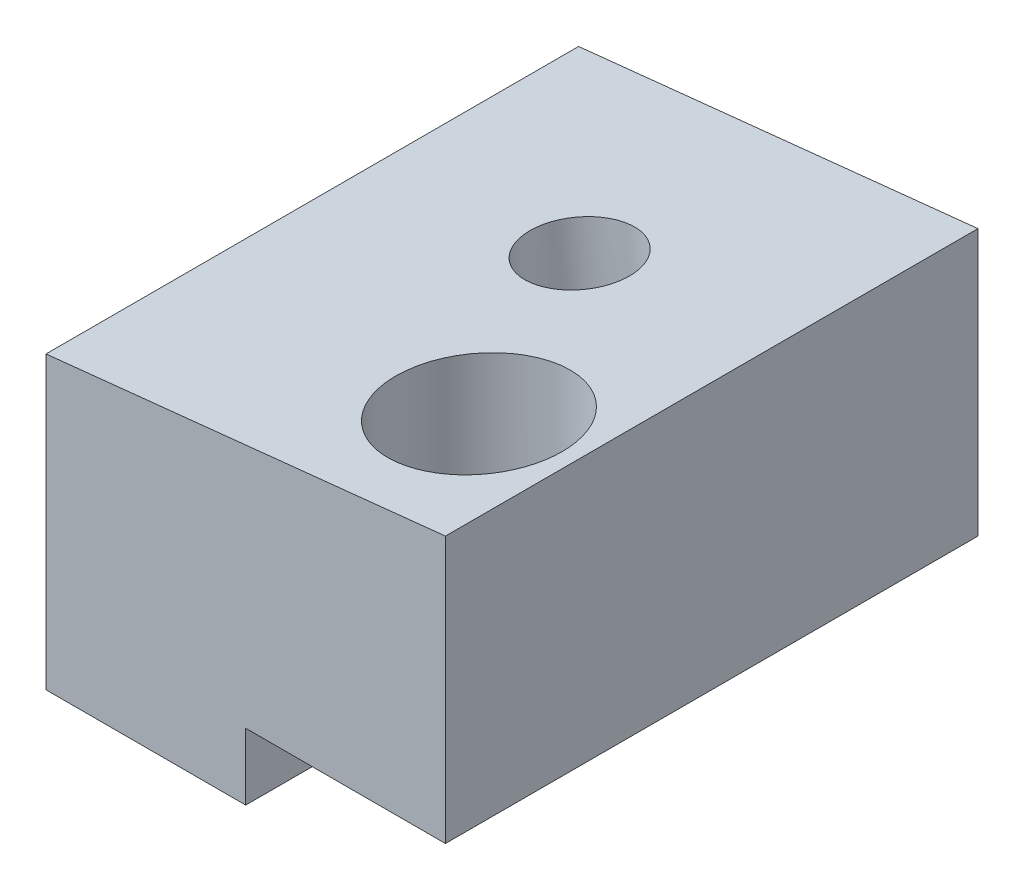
from build123d import *

# Parameters (mm, degrees)
BOSS_EXTRUDE1_DEPTH = 25.4
SKETCH3_R           = 2.3876
CUT_EXTRUDE1_DEPTH  = 15.24
SKETCH5_R           = 2.3876
CUT_EXTRUDE2_DEPTH  = 20.32
CUT_EXTRUDE3_START  = 6.35
SKETCH6_R           = 3.9624
CUT_EXTRUDE3_DEPTH  = 20.32


with BuildPart() as part:
    # Sketch1 → Boss-Extrude1 (new body)
    with BuildSketch(Plane.XY):
        Polygon((0, 0), (9.525, 0), (9.525, 12.7), (-9.525, 10.697764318), (-9.525, -3.175), (0, -3.175), align=None)
    extrude(amount=BOSS_EXTRUDE1_DEPTH)

    # Sketch3 → Cut-Extrude1 (cut)
    with BuildSketch(Plane(origin=(-1.216167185, 11.571057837, 0), x_dir=(0.9945218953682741, 0.10452846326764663, 0), z_dir=(-0.10452846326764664, 0.9945218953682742, 0))):
        with Locations(Location((1.275332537, -9.525, 0), (0, 0, 180))):
            Circle(SKETCH3_R)
    extrude(amount=-CUT_EXTRUDE1_DEPTH, mode=Mode.SUBTRACT)

    # Sketch5 → Cut-Extrude2 (cut)
    with BuildSketch(Plane(origin=(0, 0, 0), x_dir=(1, 0, 0), z_dir=(0, 1, 0))):
        with Locations(Location((4.7752, -19.05, 0), (0, 0, 180))):
            Circle(SKETCH5_R)
    extrude(amount=CUT_EXTRUDE2_DEPTH, mode=Mode.SUBTRACT)

    # Sketch6 → Cut-Extrude3 (cut)
    with BuildSketch(Plane(origin=(0, 0, 0), x_dir=(1, 0, 0), z_dir=(0, 1, 0)).offset(CUT_EXTRUDE3_START)):
        with Locations(Location((4.7752, -19.05, 0), (0, 0, 180))):
            Circle(SKETCH6_R)
    extrude(amount=CUT_EXTRUDE3_DEPTH, mode=Mode.SUBTRACT)


solid = part.part
